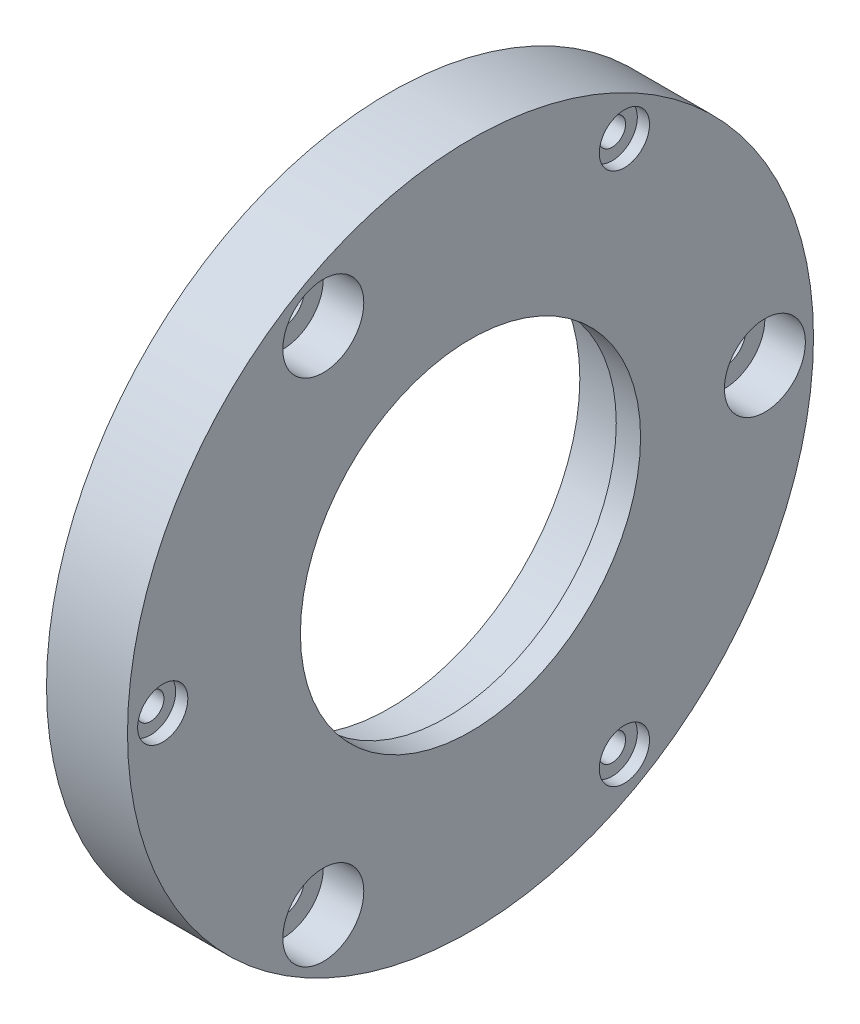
ISO-10303-21;
HEADER;
FILE_DESCRIPTION(('STEP AP214'),'2;1');
FILE_NAME('part.step','',(''),(''),'','','');
FILE_SCHEMA(('AUTOMOTIVE_DESIGN { 1 0 10303 214 1 1 1 1 }'));
ENDSEC;
DATA;
#1=APPLICATION_CONTEXT('core data for automotive mechanical design processes');
#2=APPLICATION_PROTOCOL_DEFINITION('international standard','automotive_design',2000,#1);
#3=PRODUCT_CONTEXT('',#1,'mechanical');
#4=PRODUCT('Part','Part','',(#3));
#5=PRODUCT_RELATED_PRODUCT_CATEGORY('part','',(#4));
#6=PRODUCT_DEFINITION_FORMATION('','',#4);
#7=PRODUCT_DEFINITION_CONTEXT('part definition',#1,'design');
#8=PRODUCT_DEFINITION('design','',#6,#7);
#9=PRODUCT_DEFINITION_SHAPE('','',#8);
#10=(LENGTH_UNIT() NAMED_UNIT(*) SI_UNIT(.MILLI.,.METRE.));
#11=(NAMED_UNIT(*) PLANE_ANGLE_UNIT() SI_UNIT($,.RADIAN.));
#12=(NAMED_UNIT(*) SI_UNIT($,.STERADIAN.) SOLID_ANGLE_UNIT());
#13=UNCERTAINTY_MEASURE_WITH_UNIT(LENGTH_MEASURE(1.E-05),#10,'distance_accuracy_value','');
#14=(GEOMETRIC_REPRESENTATION_CONTEXT(3) GLOBAL_UNCERTAINTY_ASSIGNED_CONTEXT((#13)) GLOBAL_UNIT_ASSIGNED_CONTEXT((#10,
#11,#12)) REPRESENTATION_CONTEXT('',''));
#15=CARTESIAN_POINT('',(0.,0.,0.));
#16=DIRECTION('',(0.,0.,1.));
#17=DIRECTION('',(1.,0.,0.));
#18=AXIS2_PLACEMENT_3D('',#15,#16,#17);
#19=CARTESIAN_POINT('',(10.,0.,0.));
#20=DIRECTION('',(-1.,0.,0.));
#21=DIRECTION('',(0.,0.,1.));
#22=AXIS2_PLACEMENT_3D('',#19,#20,#21);
#23=CYLINDRICAL_SURFACE('',#22,42.35);
#24=CARTESIAN_POINT('',(10.,0.,0.));
#25=DIRECTION('',(1.,0.,0.));
#26=DIRECTION('',(0.,0.,-1.));
#27=AXIS2_PLACEMENT_3D('',#24,#25,#26);
#28=CIRCLE('',#27,42.35);
#29=CARTESIAN_POINT('',(10.,0.,-42.35));
#30=VERTEX_POINT('',#29);
#31=EDGE_CURVE('E10',#30,#30,#28,.T.);
#32=ORIENTED_EDGE('',*,*,#31,.F.);
#33=EDGE_LOOP('',(#32));
#34=FACE_BOUND('',#33,.T.);
#35=CARTESIAN_POINT('',(0.,0.,0.));
#36=DIRECTION('',(1.,0.,0.));
#37=DIRECTION('',(0.,0.,-1.));
#38=AXIS2_PLACEMENT_3D('',#35,#36,#37);
#39=CIRCLE('',#38,42.35);
#40=CARTESIAN_POINT('',(0.,0.,-42.35));
#41=VERTEX_POINT('',#40);
#42=EDGE_CURVE('E35',#41,#41,#39,.T.);
#43=ORIENTED_EDGE('',*,*,#42,.T.);
#44=EDGE_LOOP('',(#43));
#45=FACE_BOUND('',#44,.T.);
#46=ADVANCED_FACE('F32',(#34,#45),#23,.T.);
#47=CARTESIAN_POINT('',(10.,0.,0.));
#48=DIRECTION('',(1.,0.,0.));
#49=DIRECTION('',(0.,0.,-1.));
#50=AXIS2_PLACEMENT_3D('',#47,#48,#49);
#51=PLANE('',#50);
#52=CARTESIAN_POINT('',(10.,-32.9089653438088,-18.9999999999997));
#53=DIRECTION('',(1.,0.,0.));
#54=DIRECTION('',(0.,0.866025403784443,0.499999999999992));
#55=AXIS2_PLACEMENT_3D('',#52,#53,#54);
#56=CIRCLE('',#55,3.1);
#57=CARTESIAN_POINT('',(10.,-30.2242865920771,-17.4499999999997));
#58=VERTEX_POINT('',#57);
#59=EDGE_CURVE('E110',#58,#58,#56,.T.);
#60=ORIENTED_EDGE('',*,*,#59,.F.);
#61=EDGE_LOOP('',(#60));
#62=FACE_BOUND('',#61,.T.);
#63=CARTESIAN_POINT('',(10.,32.9089653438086,-19.0000000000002));
#64=DIRECTION('',(1.,0.,0.));
#65=DIRECTION('',(0.,-0.866025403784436,0.500000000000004));
#66=AXIS2_PLACEMENT_3D('',#63,#64,#65);
#67=CIRCLE('',#66,3.1);
#68=CARTESIAN_POINT('',(10.,30.2242865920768,-17.4500000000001));
#69=VERTEX_POINT('',#68);
#70=EDGE_CURVE('E104',#69,#69,#67,.T.);
#71=ORIENTED_EDGE('',*,*,#70,.F.);
#72=EDGE_LOOP('',(#71));
#73=FACE_BOUND('',#72,.T.);
#74=CARTESIAN_POINT('',(10.,0.,38.));
#75=DIRECTION('',(1.,0.,0.));
#76=DIRECTION('',(0.,0.,-1.));
#77=AXIS2_PLACEMENT_3D('',#74,#75,#76);
#78=CIRCLE('',#77,3.1);
#79=CARTESIAN_POINT('',(10.,0.,34.9));
#80=VERTEX_POINT('',#79);
#81=EDGE_CURVE('E92',#80,#80,#78,.T.);
#82=ORIENTED_EDGE('',*,*,#81,.F.);
#83=EDGE_LOOP('',(#82));
#84=FACE_BOUND('',#83,.T.);
#85=CARTESIAN_POINT('',(10.,31.4800234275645,18.1749999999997));
#86=DIRECTION('',(1.,0.,0.));
#87=DIRECTION('',(0.,0.,-1.));
#88=AXIS2_PLACEMENT_3D('',#85,#86,#87);
#89=CIRCLE('',#88,5.);
#90=CARTESIAN_POINT('',(10.,31.4800234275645,13.1749999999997));
#91=VERTEX_POINT('',#90);
#92=EDGE_CURVE('E88',#91,#91,#89,.T.);
#93=ORIENTED_EDGE('',*,*,#92,.F.);
#94=EDGE_LOOP('',(#93));
#95=FACE_BOUND('',#94,.T.);
#96=CARTESIAN_POINT('',(10.,-31.4800234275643,18.1750000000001));
#97=DIRECTION('',(1.,0.,0.));
#98=DIRECTION('',(0.,0.,-1.));
#99=AXIS2_PLACEMENT_3D('',#96,#97,#98);
#100=CIRCLE('',#99,5.);
#101=CARTESIAN_POINT('',(10.,-31.4800234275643,13.1750000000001));
#102=VERTEX_POINT('',#101);
#103=EDGE_CURVE('E76',#102,#102,#100,.T.);
#104=ORIENTED_EDGE('',*,*,#103,.F.);
#105=EDGE_LOOP('',(#104));
#106=FACE_BOUND('',#105,.T.);
#107=CARTESIAN_POINT('',(10.,0.,-36.35));
#108=DIRECTION('',(1.,0.,0.));
#109=DIRECTION('',(0.,0.,-1.));
#110=AXIS2_PLACEMENT_3D('',#107,#108,#109);
#111=CIRCLE('',#110,5.);
#112=CARTESIAN_POINT('',(10.,0.,-41.35));
#113=VERTEX_POINT('',#112);
#114=EDGE_CURVE('E64',#113,#113,#111,.T.);
#115=ORIENTED_EDGE('',*,*,#114,.F.);
#116=EDGE_LOOP('',(#115));
#117=FACE_BOUND('',#116,.T.);
#118=CARTESIAN_POINT('',(10.,0.,0.));
#119=DIRECTION('',(1.,0.,0.));
#120=DIRECTION('',(0.,0.,-1.));
#121=AXIS2_PLACEMENT_3D('',#118,#119,#120);
#122=CIRCLE('',#121,21.);
#123=CARTESIAN_POINT('',(10.,0.,-21.));
#124=VERTEX_POINT('',#123);
#125=EDGE_CURVE('E50',#124,#124,#122,.F.);
#126=ORIENTED_EDGE('',*,*,#125,.T.);
#127=EDGE_LOOP('',(#126));
#128=FACE_BOUND('',#127,.T.);
#129=ORIENTED_EDGE('',*,*,#31,.T.);
#130=EDGE_LOOP('',(#129));
#131=FACE_BOUND('',#130,.T.);
#132=ADVANCED_FACE('F144',(#62,#73,#84,#95,#106,#117,#128,#131),#51,.T.);
#133=CARTESIAN_POINT('',(0.,0.,0.));
#134=DIRECTION('',(1.,0.,0.));
#135=DIRECTION('',(0.,0.,-1.));
#136=AXIS2_PLACEMENT_3D('',#133,#134,#135);
#137=PLANE('',#136);
#138=CARTESIAN_POINT('',(0.,-32.9089653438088,-18.9999999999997));
#139=DIRECTION('',(1.,0.,0.));
#140=DIRECTION('',(0.,0.,-1.));
#141=AXIS2_PLACEMENT_3D('',#138,#139,#140);
#142=CIRCLE('',#141,1.65);
#143=CARTESIAN_POINT('',(0.,-32.9089653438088,-20.6499999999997));
#144=VERTEX_POINT('',#143);
#145=EDGE_CURVE('E121',#144,#144,#142,.T.);
#146=ORIENTED_EDGE('',*,*,#145,.T.);
#147=EDGE_LOOP('',(#146));
#148=FACE_BOUND('',#147,.T.);
#149=CARTESIAN_POINT('',(0.,32.9089653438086,-19.0000000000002));
#150=DIRECTION('',(1.,0.,0.));
#151=DIRECTION('',(0.,0.,-1.));
#152=AXIS2_PLACEMENT_3D('',#149,#150,#151);
#153=CIRCLE('',#152,1.65);
#154=CARTESIAN_POINT('',(0.,32.9089653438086,-20.6500000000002));
#155=VERTEX_POINT('',#154);
#156=EDGE_CURVE('E113',#155,#155,#153,.T.);
#157=ORIENTED_EDGE('',*,*,#156,.T.);
#158=EDGE_LOOP('',(#157));
#159=FACE_BOUND('',#158,.T.);
#160=CARTESIAN_POINT('',(0.,0.,38.));
#161=DIRECTION('',(1.,0.,0.));
#162=DIRECTION('',(0.,0.,-1.));
#163=AXIS2_PLACEMENT_3D('',#160,#161,#162);
#164=CIRCLE('',#163,1.65);
#165=CARTESIAN_POINT('',(0.,0.,36.35));
#166=VERTEX_POINT('',#165);
#167=EDGE_CURVE('E95',#166,#166,#164,.T.);
#168=ORIENTED_EDGE('',*,*,#167,.T.);
#169=EDGE_LOOP('',(#168));
#170=FACE_BOUND('',#169,.T.);
#171=CARTESIAN_POINT('',(0.,31.4800234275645,18.1749999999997));
#172=DIRECTION('',(1.,0.,0.));
#173=DIRECTION('',(0.,0.,-1.));
#174=AXIS2_PLACEMENT_3D('',#171,#172,#173);
#175=CIRCLE('',#174,2.65);
#176=CARTESIAN_POINT('',(0.,31.4800234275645,15.5249999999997));
#177=VERTEX_POINT('',#176);
#178=EDGE_CURVE('E79',#177,#177,#175,.T.);
#179=ORIENTED_EDGE('',*,*,#178,.T.);
#180=EDGE_LOOP('',(#179));
#181=FACE_BOUND('',#180,.T.);
#182=CARTESIAN_POINT('',(0.,-31.4800234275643,18.1750000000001));
#183=DIRECTION('',(1.,0.,0.));
#184=DIRECTION('',(0.,0.,-1.));
#185=AXIS2_PLACEMENT_3D('',#182,#183,#184);
#186=CIRCLE('',#185,2.65);
#187=CARTESIAN_POINT('',(0.,-31.4800234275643,15.5250000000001));
#188=VERTEX_POINT('',#187);
#189=EDGE_CURVE('E67',#188,#188,#186,.T.);
#190=ORIENTED_EDGE('',*,*,#189,.T.);
#191=EDGE_LOOP('',(#190));
#192=FACE_BOUND('',#191,.T.);
#193=CARTESIAN_POINT('',(0.,0.,-36.35));
#194=DIRECTION('',(1.,0.,0.));
#195=DIRECTION('',(0.,0.,-1.));
#196=AXIS2_PLACEMENT_3D('',#193,#194,#195);
#197=CIRCLE('',#196,2.65);
#198=CARTESIAN_POINT('',(0.,0.,-39.));
#199=VERTEX_POINT('',#198);
#200=EDGE_CURVE('E53',#199,#199,#197,.T.);
#201=ORIENTED_EDGE('',*,*,#200,.T.);
#202=EDGE_LOOP('',(#201));
#203=FACE_BOUND('',#202,.T.);
#204=CARTESIAN_POINT('',(0.,0.,0.));
#205=DIRECTION('',(-1.,0.,0.));
#206=DIRECTION('',(0.,0.,1.));
#207=AXIS2_PLACEMENT_3D('',#204,#205,#206);
#208=CIRCLE('',#207,23.5);
#209=CARTESIAN_POINT('',(0.,0.,23.5));
#210=VERTEX_POINT('',#209);
#211=EDGE_CURVE('E44',#210,#210,#208,.T.);
#212=ORIENTED_EDGE('',*,*,#211,.F.);
#213=EDGE_LOOP('',(#212));
#214=FACE_BOUND('',#213,.T.);
#215=ORIENTED_EDGE('',*,*,#42,.F.);
#216=EDGE_LOOP('',(#215));
#217=FACE_BOUND('',#216,.T.);
#218=ADVANCED_FACE('F147',(#148,#159,#170,#181,#192,#203,#214,#217),#137,.F.);
#219=CARTESIAN_POINT('',(7.,0.,0.));
#220=DIRECTION('',(-1.,0.,0.));
#221=DIRECTION('',(0.,0.,1.));
#222=AXIS2_PLACEMENT_3D('',#219,#220,#221);
#223=CYLINDRICAL_SURFACE('',#222,23.5);
#224=CARTESIAN_POINT('',(7.,0.,0.));
#225=DIRECTION('',(-1.,0.,0.));
#226=DIRECTION('',(0.,0.,1.));
#227=AXIS2_PLACEMENT_3D('',#224,#225,#226);
#228=CIRCLE('',#227,23.5);
#229=CARTESIAN_POINT('',(7.,0.,23.5));
#230=VERTEX_POINT('',#229);
#231=EDGE_CURVE('E42',#230,#230,#228,.T.);
#232=ORIENTED_EDGE('',*,*,#231,.F.);
#233=EDGE_LOOP('',(#232));
#234=FACE_BOUND('',#233,.T.);
#235=ORIENTED_EDGE('',*,*,#211,.T.);
#236=EDGE_LOOP('',(#235));
#237=FACE_BOUND('',#236,.T.);
#238=ADVANCED_FACE('F171',(#234,#237),#223,.F.);
#239=CARTESIAN_POINT('',(7.,0.,0.));
#240=DIRECTION('',(-1.,0.,0.));
#241=DIRECTION('',(0.,0.,1.));
#242=AXIS2_PLACEMENT_3D('',#239,#240,#241);
#243=PLANE('',#242);
#244=CARTESIAN_POINT('',(7.,0.,0.));
#245=DIRECTION('',(-1.,0.,0.));
#246=DIRECTION('',(0.,0.,1.));
#247=AXIS2_PLACEMENT_3D('',#244,#245,#246);
#248=CIRCLE('',#247,21.);
#249=CARTESIAN_POINT('',(7.,0.,21.));
#250=VERTEX_POINT('',#249);
#251=EDGE_CURVE('E47',#250,#250,#248,.T.);
#252=ORIENTED_EDGE('',*,*,#251,.F.);
#253=EDGE_LOOP('',(#252));
#254=FACE_BOUND('',#253,.T.);
#255=ORIENTED_EDGE('',*,*,#231,.T.);
#256=EDGE_LOOP('',(#255));
#257=FACE_BOUND('',#256,.T.);
#258=ADVANCED_FACE('F165',(#254,#257),#243,.T.);
#259=CARTESIAN_POINT('',(10.001,0.,0.));
#260=DIRECTION('',(-1.,0.,0.));
#261=DIRECTION('',(0.,0.,1.));
#262=AXIS2_PLACEMENT_3D('',#259,#260,#261);
#263=CYLINDRICAL_SURFACE('',#262,21.);
#264=ORIENTED_EDGE('',*,*,#125,.F.);
#265=EDGE_LOOP('',(#264));
#266=FACE_BOUND('',#265,.T.);
#267=ORIENTED_EDGE('',*,*,#251,.T.);
#268=EDGE_LOOP('',(#267));
#269=FACE_BOUND('',#268,.T.);
#270=ADVANCED_FACE('F161',(#266,#269),#263,.F.);
#271=CARTESIAN_POINT('',(10.,0.,-36.35));
#272=DIRECTION('',(1.,0.,0.));
#273=DIRECTION('',(0.,0.,-1.));
#274=AXIS2_PLACEMENT_3D('',#271,#272,#273);
#275=CYLINDRICAL_SURFACE('',#274,2.65);
#276=ORIENTED_EDGE('',*,*,#200,.F.);
#277=EDGE_LOOP('',(#276));
#278=FACE_BOUND('',#277,.T.);
#279=CARTESIAN_POINT('',(5.,0.,-36.35));
#280=DIRECTION('',(1.,0.,0.));
#281=DIRECTION('',(0.,0.,-1.));
#282=AXIS2_PLACEMENT_3D('',#279,#280,#281);
#283=CIRCLE('',#282,2.65);
#284=CARTESIAN_POINT('',(5.,0.,-39.));
#285=VERTEX_POINT('',#284);
#286=EDGE_CURVE('E58',#285,#285,#283,.T.);
#287=ORIENTED_EDGE('',*,*,#286,.T.);
#288=EDGE_LOOP('',(#287));
#289=FACE_BOUND('',#288,.T.);
#290=ADVANCED_FACE('F164',(#278,#289),#275,.F.);
#291=CARTESIAN_POINT('',(5.,2.65,-36.35));
#292=DIRECTION('',(-1.,0.,0.));
#293=DIRECTION('',(0.,0.,1.));
#294=AXIS2_PLACEMENT_3D('',#291,#292,#293);
#295=PLANE('',#294);
#296=ORIENTED_EDGE('',*,*,#286,.F.);
#297=EDGE_LOOP('',(#296));
#298=FACE_BOUND('',#297,.T.);
#299=CARTESIAN_POINT('',(5.,0.,-36.35));
#300=DIRECTION('',(1.,0.,0.));
#301=DIRECTION('',(0.,0.,-1.));
#302=AXIS2_PLACEMENT_3D('',#299,#300,#301);
#303=CIRCLE('',#302,5.);
#304=CARTESIAN_POINT('',(5.,0.,-41.35));
#305=VERTEX_POINT('',#304);
#306=EDGE_CURVE('E61',#305,#305,#303,.T.);
#307=ORIENTED_EDGE('',*,*,#306,.T.);
#308=EDGE_LOOP('',(#307));
#309=FACE_BOUND('',#308,.T.);
#310=ADVANCED_FACE('F217',(#298,#309),#295,.F.);
#311=CARTESIAN_POINT('',(10.,0.,-36.35));
#312=DIRECTION('',(1.,0.,0.));
#313=DIRECTION('',(0.,0.,-1.));
#314=AXIS2_PLACEMENT_3D('',#311,#312,#313);
#315=CYLINDRICAL_SURFACE('',#314,5.);
#316=ORIENTED_EDGE('',*,*,#306,.F.);
#317=EDGE_LOOP('',(#316));
#318=FACE_BOUND('',#317,.T.);
#319=ORIENTED_EDGE('',*,*,#114,.T.);
#320=EDGE_LOOP('',(#319));
#321=FACE_BOUND('',#320,.T.);
#322=ADVANCED_FACE('F225',(#318,#321),#315,.F.);
#323=CARTESIAN_POINT('',(10.,-31.4800234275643,18.1750000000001));
#324=DIRECTION('',(1.,0.,0.));
#325=DIRECTION('',(0.,0.,-1.));
#326=AXIS2_PLACEMENT_3D('',#323,#324,#325);
#327=CYLINDRICAL_SURFACE('',#326,2.65);
#328=ORIENTED_EDGE('',*,*,#189,.F.);
#329=EDGE_LOOP('',(#328));
#330=FACE_BOUND('',#329,.T.);
#331=CARTESIAN_POINT('',(5.,-31.4800234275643,18.1750000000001));
#332=DIRECTION('',(1.,0.,0.));
#333=DIRECTION('',(0.,0.,-1.));
#334=AXIS2_PLACEMENT_3D('',#331,#332,#333);
#335=CIRCLE('',#334,2.65);
#336=CARTESIAN_POINT('',(5.,-31.4800234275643,15.5250000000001));
#337=VERTEX_POINT('',#336);
#338=EDGE_CURVE('E70',#337,#337,#335,.T.);
#339=ORIENTED_EDGE('',*,*,#338,.T.);
#340=EDGE_LOOP('',(#339));
#341=FACE_BOUND('',#340,.T.);
#342=ADVANCED_FACE('F233',(#330,#341),#327,.F.);
#343=CARTESIAN_POINT('',(5.,-28.8300234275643,18.1750000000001));
#344=DIRECTION('',(-1.,0.,0.));
#345=DIRECTION('',(0.,0.,1.));
#346=AXIS2_PLACEMENT_3D('',#343,#344,#345);
#347=PLANE('',#346);
#348=ORIENTED_EDGE('',*,*,#338,.F.);
#349=EDGE_LOOP('',(#348));
#350=FACE_BOUND('',#349,.T.);
#351=CARTESIAN_POINT('',(5.,-31.4800234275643,18.1750000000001));
#352=DIRECTION('',(1.,0.,0.));
#353=DIRECTION('',(0.,0.,-1.));
#354=AXIS2_PLACEMENT_3D('',#351,#352,#353);
#355=CIRCLE('',#354,5.);
#356=CARTESIAN_POINT('',(5.,-31.4800234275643,13.1750000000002));
#357=VERTEX_POINT('',#356);
#358=EDGE_CURVE('E73',#357,#357,#355,.T.);
#359=ORIENTED_EDGE('',*,*,#358,.T.);
#360=EDGE_LOOP('',(#359));
#361=FACE_BOUND('',#360,.T.);
#362=ADVANCED_FACE('F241',(#350,#361),#347,.F.);
#363=CARTESIAN_POINT('',(10.,-31.4800234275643,18.1750000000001));
#364=DIRECTION('',(1.,0.,0.));
#365=DIRECTION('',(0.,0.,-1.));
#366=AXIS2_PLACEMENT_3D('',#363,#364,#365);
#367=CYLINDRICAL_SURFACE('',#366,5.);
#368=ORIENTED_EDGE('',*,*,#358,.F.);
#369=EDGE_LOOP('',(#368));
#370=FACE_BOUND('',#369,.T.);
#371=ORIENTED_EDGE('',*,*,#103,.T.);
#372=EDGE_LOOP('',(#371));
#373=FACE_BOUND('',#372,.T.);
#374=ADVANCED_FACE('F249',(#370,#373),#367,.F.);
#375=CARTESIAN_POINT('',(10.,31.4800234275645,18.1749999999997));
#376=DIRECTION('',(1.,0.,0.));
#377=DIRECTION('',(0.,0.,-1.));
#378=AXIS2_PLACEMENT_3D('',#375,#376,#377);
#379=CYLINDRICAL_SURFACE('',#378,2.65);
#380=ORIENTED_EDGE('',*,*,#178,.F.);
#381=EDGE_LOOP('',(#380));
#382=FACE_BOUND('',#381,.T.);
#383=CARTESIAN_POINT('',(5.,31.4800234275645,18.1749999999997));
#384=DIRECTION('',(1.,0.,0.));
#385=DIRECTION('',(0.,0.,-1.));
#386=AXIS2_PLACEMENT_3D('',#383,#384,#385);
#387=CIRCLE('',#386,2.65);
#388=CARTESIAN_POINT('',(5.,31.4800234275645,15.5249999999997));
#389=VERTEX_POINT('',#388);
#390=EDGE_CURVE('E82',#389,#389,#387,.T.);
#391=ORIENTED_EDGE('',*,*,#390,.T.);
#392=EDGE_LOOP('',(#391));
#393=FACE_BOUND('',#392,.T.);
#394=ADVANCED_FACE('F257',(#382,#393),#379,.F.);
#395=CARTESIAN_POINT('',(5.,34.1300234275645,18.1749999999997));
#396=DIRECTION('',(-1.,0.,0.));
#397=DIRECTION('',(0.,0.,1.));
#398=AXIS2_PLACEMENT_3D('',#395,#396,#397);
#399=PLANE('',#398);
#400=ORIENTED_EDGE('',*,*,#390,.F.);
#401=EDGE_LOOP('',(#400));
#402=FACE_BOUND('',#401,.T.);
#403=CARTESIAN_POINT('',(5.,31.4800234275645,18.1749999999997));
#404=DIRECTION('',(1.,0.,0.));
#405=DIRECTION('',(0.,0.,-1.));
#406=AXIS2_PLACEMENT_3D('',#403,#404,#405);
#407=CIRCLE('',#406,5.);
#408=CARTESIAN_POINT('',(5.,31.4800234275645,13.1749999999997));
#409=VERTEX_POINT('',#408);
#410=EDGE_CURVE('E85',#409,#409,#407,.T.);
#411=ORIENTED_EDGE('',*,*,#410,.T.);
#412=EDGE_LOOP('',(#411));
#413=FACE_BOUND('',#412,.T.);
#414=ADVANCED_FACE('F265',(#402,#413),#399,.F.);
#415=CARTESIAN_POINT('',(10.,31.4800234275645,18.1749999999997));
#416=DIRECTION('',(1.,0.,0.));
#417=DIRECTION('',(0.,0.,-1.));
#418=AXIS2_PLACEMENT_3D('',#415,#416,#417);
#419=CYLINDRICAL_SURFACE('',#418,5.);
#420=ORIENTED_EDGE('',*,*,#410,.F.);
#421=EDGE_LOOP('',(#420));
#422=FACE_BOUND('',#421,.T.);
#423=ORIENTED_EDGE('',*,*,#92,.T.);
#424=EDGE_LOOP('',(#423));
#425=FACE_BOUND('',#424,.T.);
#426=ADVANCED_FACE('F273',(#422,#425),#419,.F.);
#427=CARTESIAN_POINT('',(8.5,0.,38.));
#428=DIRECTION('',(1.,0.,0.));
#429=DIRECTION('',(0.,0.,-1.));
#430=AXIS2_PLACEMENT_3D('',#427,#428,#429);
#431=CYLINDRICAL_SURFACE('',#430,3.1);
#432=CARTESIAN_POINT('',(8.5,0.,38.));
#433=DIRECTION('',(1.,0.,0.));
#434=DIRECTION('',(0.,0.,-1.));
#435=AXIS2_PLACEMENT_3D('',#432,#433,#434);
#436=CIRCLE('',#435,3.1);
#437=CARTESIAN_POINT('',(8.5,0.,34.9));
#438=VERTEX_POINT('',#437);
#439=EDGE_CURVE('E91',#438,#438,#436,.T.);
#440=ORIENTED_EDGE('',*,*,#439,.F.);
#441=EDGE_LOOP('',(#440));
#442=FACE_BOUND('',#441,.T.);
#443=ORIENTED_EDGE('',*,*,#81,.T.);
#444=EDGE_LOOP('',(#443));
#445=FACE_BOUND('',#444,.T.);
#446=ADVANCED_FACE('F281',(#442,#445),#431,.F.);
#447=CARTESIAN_POINT('',(8.5,0.,38.));
#448=DIRECTION('',(1.,0.,0.));
#449=DIRECTION('',(0.,0.,-1.));
#450=AXIS2_PLACEMENT_3D('',#447,#448,#449);
#451=PLANE('',#450);
#452=CARTESIAN_POINT('',(8.5,0.,38.));
#453=DIRECTION('',(1.,0.,0.));
#454=DIRECTION('',(0.,0.,-1.));
#455=AXIS2_PLACEMENT_3D('',#452,#453,#454);
#456=CIRCLE('',#455,1.64999999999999);
#457=CARTESIAN_POINT('',(8.5,0.,36.35));
#458=VERTEX_POINT('',#457);
#459=EDGE_CURVE('E100',#458,#458,#456,.T.);
#460=ORIENTED_EDGE('',*,*,#459,.F.);
#461=EDGE_LOOP('',(#460));
#462=FACE_BOUND('',#461,.T.);
#463=ORIENTED_EDGE('',*,*,#439,.T.);
#464=EDGE_LOOP('',(#463));
#465=FACE_BOUND('',#464,.T.);
#466=ADVANCED_FACE('F289',(#462,#465),#451,.T.);
#467=CARTESIAN_POINT('',(8.5,0.,38.));
#468=DIRECTION('',(1.,0.,0.));
#469=DIRECTION('',(0.,0.,-1.));
#470=AXIS2_PLACEMENT_3D('',#467,#468,#469);
#471=CYLINDRICAL_SURFACE('',#470,1.64999999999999);
#472=ORIENTED_EDGE('',*,*,#167,.F.);
#473=EDGE_LOOP('',(#472));
#474=FACE_BOUND('',#473,.T.);
#475=ORIENTED_EDGE('',*,*,#459,.T.);
#476=EDGE_LOOP('',(#475));
#477=FACE_BOUND('',#476,.T.);
#478=ADVANCED_FACE('F297',(#474,#477),#471,.F.);
#479=CARTESIAN_POINT('',(8.5,32.9089653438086,-19.0000000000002));
#480=DIRECTION('',(1.,0.,0.));
#481=DIRECTION('',(0.,0.,-1.));
#482=AXIS2_PLACEMENT_3D('',#479,#480,#481);
#483=CYLINDRICAL_SURFACE('',#482,3.1);
#484=CARTESIAN_POINT('',(8.5,32.9089653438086,-19.0000000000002));
#485=DIRECTION('',(1.,0.,0.));
#486=DIRECTION('',(0.,-0.866025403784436,0.500000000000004));
#487=AXIS2_PLACEMENT_3D('',#484,#485,#486);
#488=CIRCLE('',#487,3.1);
#489=CARTESIAN_POINT('',(8.5,30.2242865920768,-17.4500000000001));
#490=VERTEX_POINT('',#489);
#491=EDGE_CURVE('E103',#490,#490,#488,.T.);
#492=ORIENTED_EDGE('',*,*,#491,.F.);
#493=EDGE_LOOP('',(#492));
#494=FACE_BOUND('',#493,.T.);
#495=ORIENTED_EDGE('',*,*,#70,.T.);
#496=EDGE_LOOP('',(#495));
#497=FACE_BOUND('',#496,.T.);
#498=ADVANCED_FACE('F305',(#494,#497),#483,.F.);
#499=CARTESIAN_POINT('',(8.5,32.9089653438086,-19.0000000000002));
#500=DIRECTION('',(1.,0.,0.));
#501=DIRECTION('',(0.,-0.866025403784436,0.500000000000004));
#502=AXIS2_PLACEMENT_3D('',#499,#500,#501);
#503=PLANE('',#502);
#504=CARTESIAN_POINT('',(8.5,32.9089653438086,-19.0000000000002));
#505=DIRECTION('',(1.,0.,0.));
#506=DIRECTION('',(0.,0.,-1.));
#507=AXIS2_PLACEMENT_3D('',#504,#505,#506);
#508=CIRCLE('',#507,1.64999999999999);
#509=CARTESIAN_POINT('',(8.5,32.9089653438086,-20.6500000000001));
#510=VERTEX_POINT('',#509);
#511=EDGE_CURVE('E118',#510,#510,#508,.T.);
#512=ORIENTED_EDGE('',*,*,#511,.F.);
#513=EDGE_LOOP('',(#512));
#514=FACE_BOUND('',#513,.T.);
#515=ORIENTED_EDGE('',*,*,#491,.T.);
#516=EDGE_LOOP('',(#515));
#517=FACE_BOUND('',#516,.T.);
#518=ADVANCED_FACE('F140',(#514,#517),#503,.T.);
#519=CARTESIAN_POINT('',(8.5,-32.9089653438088,-18.9999999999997));
#520=DIRECTION('',(1.,0.,0.));
#521=DIRECTION('',(0.,0.,-1.));
#522=AXIS2_PLACEMENT_3D('',#519,#520,#521);
#523=CYLINDRICAL_SURFACE('',#522,3.1);
#524=CARTESIAN_POINT('',(8.5,-32.9089653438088,-18.9999999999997));
#525=DIRECTION('',(1.,0.,0.));
#526=DIRECTION('',(0.,0.866025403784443,0.499999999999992));
#527=AXIS2_PLACEMENT_3D('',#524,#525,#526);
#528=CIRCLE('',#527,3.1);
#529=CARTESIAN_POINT('',(8.5,-30.2242865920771,-17.4499999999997));
#530=VERTEX_POINT('',#529);
#531=EDGE_CURVE('E107',#530,#530,#528,.T.);
#532=ORIENTED_EDGE('',*,*,#531,.F.);
#533=EDGE_LOOP('',(#532));
#534=FACE_BOUND('',#533,.T.);
#535=ORIENTED_EDGE('',*,*,#59,.T.);
#536=EDGE_LOOP('',(#535));
#537=FACE_BOUND('',#536,.T.);
#538=ADVANCED_FACE('F134',(#534,#537),#523,.F.);
#539=CARTESIAN_POINT('',(8.5,-32.9089653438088,-18.9999999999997));
#540=DIRECTION('',(1.,0.,0.));
#541=DIRECTION('',(0.,0.866025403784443,0.499999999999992));
#542=AXIS2_PLACEMENT_3D('',#539,#540,#541);
#543=PLANE('',#542);
#544=CARTESIAN_POINT('',(8.5,-32.9089653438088,-18.9999999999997));
#545=DIRECTION('',(1.,0.,0.));
#546=DIRECTION('',(0.,0.,-1.));
#547=AXIS2_PLACEMENT_3D('',#544,#545,#546);
#548=CIRCLE('',#547,1.64999999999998);
#549=CARTESIAN_POINT('',(8.5,-32.9089653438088,-20.6499999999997));
#550=VERTEX_POINT('',#549);
#551=EDGE_CURVE('E124',#550,#550,#548,.T.);
#552=ORIENTED_EDGE('',*,*,#551,.F.);
#553=EDGE_LOOP('',(#552));
#554=FACE_BOUND('',#553,.T.);
#555=ORIENTED_EDGE('',*,*,#531,.T.);
#556=EDGE_LOOP('',(#555));
#557=FACE_BOUND('',#556,.T.);
#558=ADVANCED_FACE('F130',(#554,#557),#543,.T.);
#559=CARTESIAN_POINT('',(8.5,32.9089653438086,-19.0000000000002));
#560=DIRECTION('',(1.,0.,0.));
#561=DIRECTION('',(0.,0.,-1.));
#562=AXIS2_PLACEMENT_3D('',#559,#560,#561);
#563=CYLINDRICAL_SURFACE('',#562,1.65);
#564=ORIENTED_EDGE('',*,*,#156,.F.);
#565=EDGE_LOOP('',(#564));
#566=FACE_BOUND('',#565,.T.);
#567=ORIENTED_EDGE('',*,*,#511,.T.);
#568=EDGE_LOOP('',(#567));
#569=FACE_BOUND('',#568,.T.);
#570=ADVANCED_FACE('F133',(#566,#569),#563,.F.);
#571=CARTESIAN_POINT('',(8.5,-32.9089653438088,-18.9999999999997));
#572=DIRECTION('',(1.,0.,0.));
#573=DIRECTION('',(0.,0.,-1.));
#574=AXIS2_PLACEMENT_3D('',#571,#572,#573);
#575=CYLINDRICAL_SURFACE('',#574,1.64999999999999);
#576=ORIENTED_EDGE('',*,*,#145,.F.);
#577=EDGE_LOOP('',(#576));
#578=FACE_BOUND('',#577,.T.);
#579=ORIENTED_EDGE('',*,*,#551,.T.);
#580=EDGE_LOOP('',(#579));
#581=FACE_BOUND('',#580,.T.);
#582=ADVANCED_FACE('F128',(#578,#581),#575,.F.);
#583=CLOSED_SHELL('',(#46,#132,#218,#238,#258,#270,#290,#310,#322,#342,#362,#374,#394,#414,#426,
#446,#466,#478,#498,#518,#538,#558,#570,#582));
#584=MANIFOLD_SOLID_BREP('B2',#583);
#585=ADVANCED_BREP_SHAPE_REPRESENTATION('',(#18,#584),#14);
#586=SHAPE_DEFINITION_REPRESENTATION(#9,#585);
ENDSEC;
END-ISO-10303-21;
